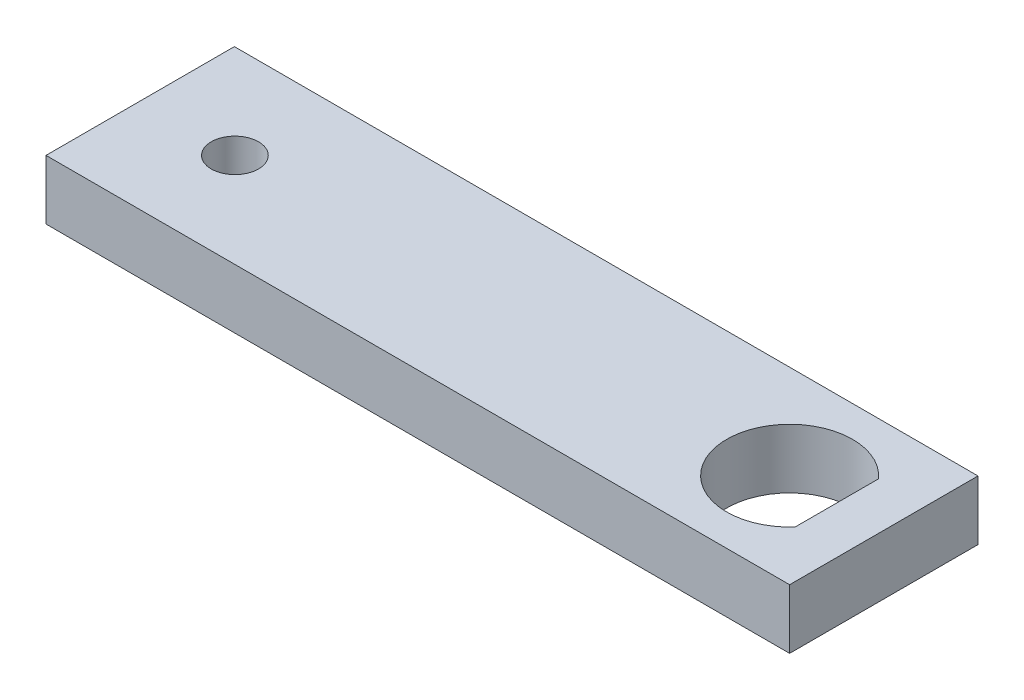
from build123d import *

# Parameters (mm, degrees)
SKETCH1_W          = 75
SKETCH1_H          = 6
BASE_EXTRUDE_DEPTH = 19
CUT_EXTRUDE1_DEPTH = 78.601546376
SKETCH3_R          = 2.38125
CUT_EXTRUDE2_DEPTH = 78.601546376


with BuildPart() as part:
    # Sketch1 → Base-Extrude (new body)
    with BuildSketch(Plane.XY):
        with Locations((37.5, 3)):
            Rectangle(SKETCH1_W, SKETCH1_H)
    extrude(amount=BASE_EXTRUDE_DEPTH)

    # Sketch2 → Cut-Extrude1 (cut, through all)
    with BuildSketch(Plane(origin=(0, 6, 0), x_dir=(-1, 0, 0), z_dir=(0, 1, 0))):
        with BuildLine():
            Line((-70.2375, 5.274869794), (-70.2375, 13.675130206))
            ThreePointArc((-70.2375, 13.675130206), (-59.125, 9.475), (-70.2375, 5.274869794))
        make_face()
    extrude(amount=-CUT_EXTRUDE1_DEPTH, mode=Mode.SUBTRACT)

    # Sketch3 → Cut-Extrude2 (cut, through all)
    with BuildSketch(Plane(origin=(0, 6, 0), x_dir=(-1, 0, 0), z_dir=(0, 1, 0))):
        with Locations((-9.525, 9.475)):
            Circle(SKETCH3_R)
    extrude(amount=-CUT_EXTRUDE2_DEPTH, mode=Mode.SUBTRACT)


solid = part.part
